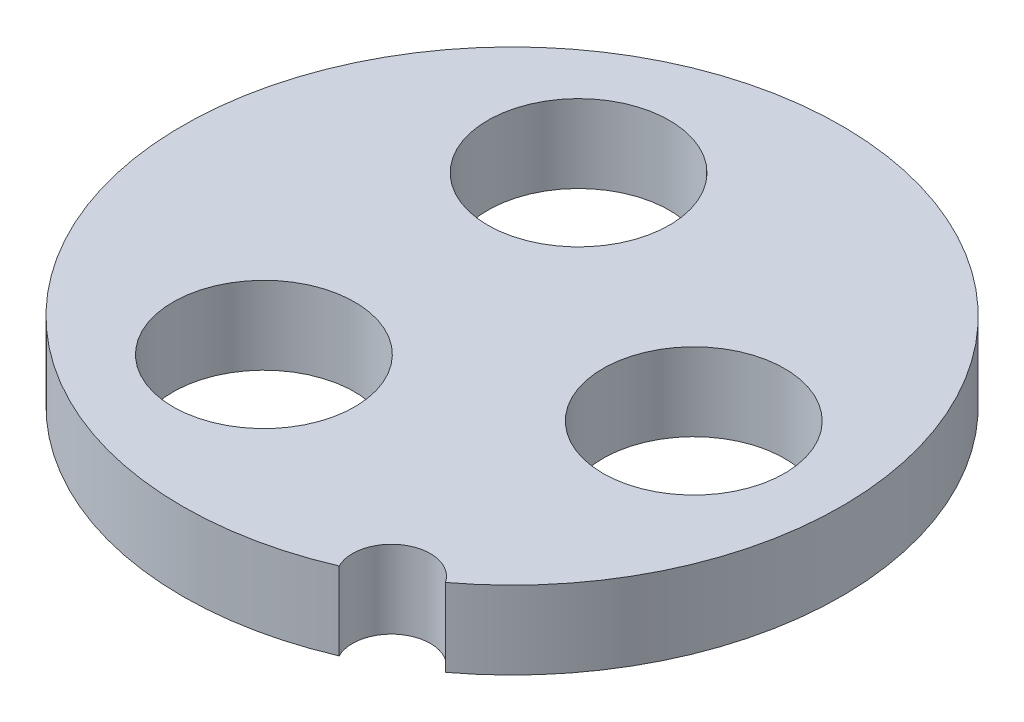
ISO-10303-21;
HEADER;
FILE_DESCRIPTION(('STEP AP214'),'2;1');
FILE_NAME('part.step','',(''),(''),'','','');
FILE_SCHEMA(('AUTOMOTIVE_DESIGN { 1 0 10303 214 1 1 1 1 }'));
ENDSEC;
DATA;
#1=APPLICATION_CONTEXT('core data for automotive mechanical design processes');
#2=APPLICATION_PROTOCOL_DEFINITION('international standard','automotive_design',2000,#1);
#3=PRODUCT_CONTEXT('',#1,'mechanical');
#4=PRODUCT('Part','Part','',(#3));
#5=PRODUCT_RELATED_PRODUCT_CATEGORY('part','',(#4));
#6=PRODUCT_DEFINITION_FORMATION('','',#4);
#7=PRODUCT_DEFINITION_CONTEXT('part definition',#1,'design');
#8=PRODUCT_DEFINITION('design','',#6,#7);
#9=PRODUCT_DEFINITION_SHAPE('','',#8);
#10=(LENGTH_UNIT() NAMED_UNIT(*) SI_UNIT(.MILLI.,.METRE.));
#11=(NAMED_UNIT(*) PLANE_ANGLE_UNIT() SI_UNIT($,.RADIAN.));
#12=(NAMED_UNIT(*) SI_UNIT($,.STERADIAN.) SOLID_ANGLE_UNIT());
#13=UNCERTAINTY_MEASURE_WITH_UNIT(LENGTH_MEASURE(1.E-05),#10,'distance_accuracy_value','');
#14=(GEOMETRIC_REPRESENTATION_CONTEXT(3) GLOBAL_UNCERTAINTY_ASSIGNED_CONTEXT((#13)) GLOBAL_UNIT_ASSIGNED_CONTEXT((#10,
#11,#12)) REPRESENTATION_CONTEXT('',''));
#15=CARTESIAN_POINT('',(0.,0.,0.));
#16=DIRECTION('',(0.,0.,1.));
#17=DIRECTION('',(1.,0.,0.));
#18=AXIS2_PLACEMENT_3D('',#15,#16,#17);
#19=CARTESIAN_POINT('',(0.,1.5,0.));
#20=DIRECTION('',(0.,1.,0.));
#21=DIRECTION('',(0.,0.,1.));
#22=AXIS2_PLACEMENT_3D('',#19,#20,#21);
#23=PLANE('',#22);
#24=CARTESIAN_POINT('',(3.17500000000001,1.5,5.49926131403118));
#25=DIRECTION('',(0.,-1.,0.));
#26=DIRECTION('',(0.,0.,-1.));
#27=AXIS2_PLACEMENT_3D('',#24,#25,#26);
#28=CIRCLE('',#27,0.75);
#29=CARTESIAN_POINT('',(2.5044688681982,1.5,5.83524941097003));
#30=VERTEX_POINT('',#29);
#31=CARTESIAN_POINT('',(3.80123979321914,1.5,5.0865583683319));
#32=VERTEX_POINT('',#31);
#33=EDGE_CURVE('E47',#30,#32,#28,.T.);
#34=ORIENTED_EDGE('',*,*,#33,.T.);
#35=CARTESIAN_POINT('',(0.,1.5,0.));
#36=DIRECTION('',(0.,1.,0.));
#37=DIRECTION('',(0.,0.,1.));
#38=AXIS2_PLACEMENT_3D('',#35,#36,#37);
#39=CIRCLE('',#38,6.35);
#40=EDGE_CURVE('E62',#32,#30,#39,.T.);
#41=ORIENTED_EDGE('',*,*,#40,.T.);
#42=EDGE_LOOP('',(#34,#41));
#43=FACE_BOUND('',#42,.T.);
#44=CARTESIAN_POINT('',(-1.75,1.5,3.03108891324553));
#45=DIRECTION('',(0.,1.,0.));
#46=DIRECTION('',(0.,0.,1.));
#47=AXIS2_PLACEMENT_3D('',#44,#45,#46);
#48=CIRCLE('',#47,1.75);
#49=CARTESIAN_POINT('',(-1.75,1.5,4.78108891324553));
#50=VERTEX_POINT('',#49);
#51=EDGE_CURVE('E72',#50,#50,#48,.T.);
#52=ORIENTED_EDGE('',*,*,#51,.F.);
#53=EDGE_LOOP('',(#52));
#54=FACE_BOUND('',#53,.T.);
#55=CARTESIAN_POINT('',(3.5,1.5,0.));
#56=DIRECTION('',(0.,1.,0.));
#57=DIRECTION('',(0.,0.,1.));
#58=AXIS2_PLACEMENT_3D('',#55,#56,#57);
#59=CIRCLE('',#58,1.75);
#60=CARTESIAN_POINT('',(3.5,1.5,1.75));
#61=VERTEX_POINT('',#60);
#62=EDGE_CURVE('E63',#61,#61,#59,.T.);
#63=ORIENTED_EDGE('',*,*,#62,.F.);
#64=EDGE_LOOP('',(#63));
#65=FACE_BOUND('',#64,.T.);
#66=CARTESIAN_POINT('',(-1.75,1.5,-3.03108891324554));
#67=DIRECTION('',(0.,1.,0.));
#68=DIRECTION('',(0.,0.,1.));
#69=AXIS2_PLACEMENT_3D('',#66,#67,#68);
#70=CIRCLE('',#69,1.75);
#71=CARTESIAN_POINT('',(-1.75,1.5,-1.28108891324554));
#72=VERTEX_POINT('',#71);
#73=EDGE_CURVE('E78',#72,#72,#70,.T.);
#74=ORIENTED_EDGE('',*,*,#73,.F.);
#75=EDGE_LOOP('',(#74));
#76=FACE_BOUND('',#75,.T.);
#77=ADVANCED_FACE('F27',(#43,#54,#65,#76),#23,.T.);
#78=CARTESIAN_POINT('',(0.,0.,0.));
#79=DIRECTION('',(0.,1.,0.));
#80=DIRECTION('',(0.,0.,1.));
#81=AXIS2_PLACEMENT_3D('',#78,#79,#80);
#82=PLANE('',#81);
#83=CARTESIAN_POINT('',(-1.75,0.,3.03108891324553));
#84=DIRECTION('',(0.,1.,0.));
#85=DIRECTION('',(0.,0.,1.));
#86=AXIS2_PLACEMENT_3D('',#83,#84,#85);
#87=CIRCLE('',#86,1.75);
#88=CARTESIAN_POINT('',(-1.75,0.,4.78108891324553));
#89=VERTEX_POINT('',#88);
#90=EDGE_CURVE('E75',#89,#89,#87,.T.);
#91=ORIENTED_EDGE('',*,*,#90,.T.);
#92=EDGE_LOOP('',(#91));
#93=FACE_BOUND('',#92,.T.);
#94=CARTESIAN_POINT('',(0.,0.,0.));
#95=DIRECTION('',(0.,1.,0.));
#96=DIRECTION('',(0.,0.,1.));
#97=AXIS2_PLACEMENT_3D('',#94,#95,#96);
#98=CIRCLE('',#97,6.35);
#99=CARTESIAN_POINT('',(3.80123979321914,0.,5.0865583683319));
#100=VERTEX_POINT('',#99);
#101=CARTESIAN_POINT('',(2.5044688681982,0.,5.83524941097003));
#102=VERTEX_POINT('',#101);
#103=EDGE_CURVE('E60',#100,#102,#98,.T.);
#104=ORIENTED_EDGE('',*,*,#103,.F.);
#105=CARTESIAN_POINT('',(3.17500000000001,0.,5.49926131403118));
#106=DIRECTION('',(0.,-1.,0.));
#107=DIRECTION('',(0.,0.,-1.));
#108=AXIS2_PLACEMENT_3D('',#105,#106,#107);
#109=CIRCLE('',#108,0.75);
#110=EDGE_CURVE('E42',#102,#100,#109,.T.);
#111=ORIENTED_EDGE('',*,*,#110,.F.);
#112=EDGE_LOOP('',(#104,#111));
#113=FACE_BOUND('',#112,.T.);
#114=CARTESIAN_POINT('',(3.5,0.,0.));
#115=DIRECTION('',(0.,1.,0.));
#116=DIRECTION('',(0.,0.,1.));
#117=AXIS2_PLACEMENT_3D('',#114,#115,#116);
#118=CIRCLE('',#117,1.75);
#119=CARTESIAN_POINT('',(3.5,0.,1.75));
#120=VERTEX_POINT('',#119);
#121=EDGE_CURVE('E67',#120,#120,#118,.T.);
#122=ORIENTED_EDGE('',*,*,#121,.T.);
#123=EDGE_LOOP('',(#122));
#124=FACE_BOUND('',#123,.T.);
#125=CARTESIAN_POINT('',(-1.75,0.,-3.03108891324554));
#126=DIRECTION('',(0.,1.,0.));
#127=DIRECTION('',(0.,0.,1.));
#128=AXIS2_PLACEMENT_3D('',#125,#126,#127);
#129=CIRCLE('',#128,1.75);
#130=CARTESIAN_POINT('',(-1.75,0.,-1.28108891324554));
#131=VERTEX_POINT('',#130);
#132=EDGE_CURVE('E81',#131,#131,#129,.T.);
#133=ORIENTED_EDGE('',*,*,#132,.T.);
#134=EDGE_LOOP('',(#133));
#135=FACE_BOUND('',#134,.T.);
#136=ADVANCED_FACE('F58',(#93,#113,#124,#135),#82,.F.);
#137=CARTESIAN_POINT('',(0.,1.5,0.));
#138=DIRECTION('',(0.,-1.,0.));
#139=DIRECTION('',(0.,0.,-1.));
#140=AXIS2_PLACEMENT_3D('',#137,#138,#139);
#141=CYLINDRICAL_SURFACE('',#140,6.35);
#142=ORIENTED_EDGE('',*,*,#103,.T.);
#143=DIRECTION('',(0.,-1.,0.));
#144=VECTOR('',#143,1.);
#145=CARTESIAN_POINT('',(2.5044688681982,0.75,5.83524941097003));
#146=LINE('',#145,#144);
#147=EDGE_CURVE('E11',#102,#30,#146,.F.);
#148=ORIENTED_EDGE('',*,*,#147,.T.);
#149=ORIENTED_EDGE('',*,*,#40,.F.);
#150=DIRECTION('',(0.,-1.,0.));
#151=VECTOR('',#150,1.);
#152=CARTESIAN_POINT('',(3.80123979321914,0.75,5.0865583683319));
#153=LINE('',#152,#151);
#154=EDGE_CURVE('E35',#32,#100,#153,.T.);
#155=ORIENTED_EDGE('',*,*,#154,.T.);
#156=EDGE_LOOP('',(#142,#148,#149,#155));
#157=FACE_BOUND('',#156,.T.);
#158=ADVANCED_FACE('F29',(#157),#141,.T.);
#159=CARTESIAN_POINT('',(3.5,1.5,0.));
#160=DIRECTION('',(0.,-1.,0.));
#161=DIRECTION('',(0.,0.,-1.));
#162=AXIS2_PLACEMENT_3D('',#159,#160,#161);
#163=CYLINDRICAL_SURFACE('',#162,1.75);
#164=ORIENTED_EDGE('',*,*,#62,.T.);
#165=EDGE_LOOP('',(#164));
#166=FACE_BOUND('',#165,.T.);
#167=ORIENTED_EDGE('',*,*,#121,.F.);
#168=EDGE_LOOP('',(#167));
#169=FACE_BOUND('',#168,.T.);
#170=ADVANCED_FACE('F106',(#166,#169),#163,.F.);
#171=CARTESIAN_POINT('',(-1.75,1.5,3.03108891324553));
#172=DIRECTION('',(0.,-1.,0.));
#173=DIRECTION('',(0.,0.,-1.));
#174=AXIS2_PLACEMENT_3D('',#171,#172,#173);
#175=CYLINDRICAL_SURFACE('',#174,1.75);
#176=ORIENTED_EDGE('',*,*,#51,.T.);
#177=EDGE_LOOP('',(#176));
#178=FACE_BOUND('',#177,.T.);
#179=ORIENTED_EDGE('',*,*,#90,.F.);
#180=EDGE_LOOP('',(#179));
#181=FACE_BOUND('',#180,.T.);
#182=ADVANCED_FACE('F96',(#178,#181),#175,.F.);
#183=CARTESIAN_POINT('',(-1.75,1.5,-3.03108891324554));
#184=DIRECTION('',(0.,-1.,0.));
#185=DIRECTION('',(0.,0.,-1.));
#186=AXIS2_PLACEMENT_3D('',#183,#184,#185);
#187=CYLINDRICAL_SURFACE('',#186,1.75);
#188=ORIENTED_EDGE('',*,*,#73,.T.);
#189=EDGE_LOOP('',(#188));
#190=FACE_BOUND('',#189,.T.);
#191=ORIENTED_EDGE('',*,*,#132,.F.);
#192=EDGE_LOOP('',(#191));
#193=FACE_BOUND('',#192,.T.);
#194=ADVANCED_FACE('F93',(#190,#193),#187,.F.);
#195=CARTESIAN_POINT('',(3.17500000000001,1.5,5.49926131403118));
#196=DIRECTION('',(0.,-1.,0.));
#197=DIRECTION('',(0.,0.,-1.));
#198=AXIS2_PLACEMENT_3D('',#195,#196,#197);
#199=CYLINDRICAL_SURFACE('',#198,0.75);
#200=ORIENTED_EDGE('',*,*,#110,.T.);
#201=ORIENTED_EDGE('',*,*,#154,.F.);
#202=ORIENTED_EDGE('',*,*,#33,.F.);
#203=ORIENTED_EDGE('',*,*,#147,.F.);
#204=EDGE_LOOP('',(#200,#201,#202,#203));
#205=FACE_BOUND('',#204,.T.);
#206=ADVANCED_FACE('F51',(#205),#199,.F.);
#207=CLOSED_SHELL('',(#77,#136,#158,#170,#182,#194,#206));
#208=MANIFOLD_SOLID_BREP('B2',#207);
#209=ADVANCED_BREP_SHAPE_REPRESENTATION('',(#18,#208),#14);
#210=SHAPE_DEFINITION_REPRESENTATION(#9,#209);
ENDSEC;
END-ISO-10303-21;
